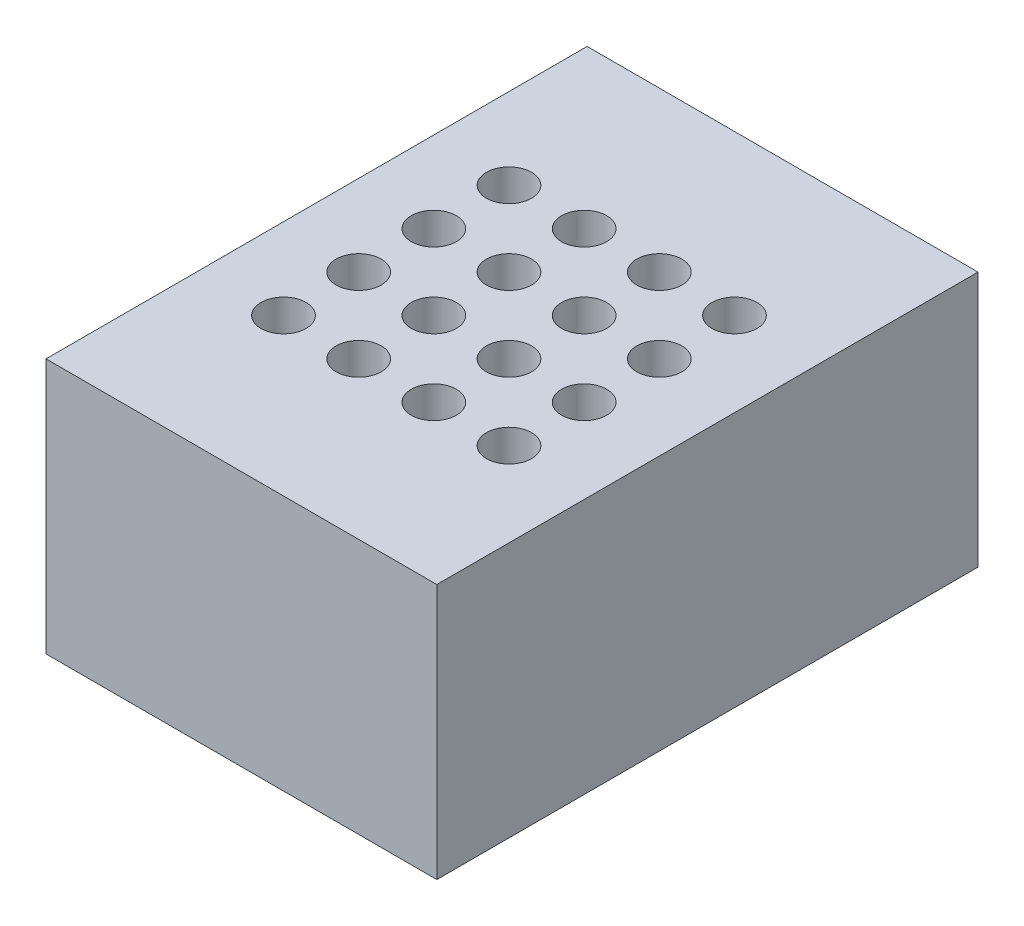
from build123d import *

# Parameters (mm, degrees)
SKETCH1_W           = 13
SKETCH1_H           = 18
BOSS_EXTRUDE1_DEPTH = 8.5
SKETCH2_R           = 0.75
CUT_EXTRUDE1_DEPTH  = 7
SKETCH3_W           = 9.571128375
SKETCH3_H           = 1.059255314
SKETCH3_H_2         = 1.210577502
CUT_EXTRUDE2_DEPTH  = 1.5


with BuildPart() as part:
    # Sketch1 → Boss-Extrude1 (new body)
    with BuildSketch(Plane(origin=(0, 0, 0), x_dir=(1, 0, 0), z_dir=(0, 1, 0))):
        with Locations((0.665012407, -3.305210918)):
            Rectangle(SKETCH1_W, SKETCH1_H)
    extrude(amount=BOSS_EXTRUDE1_DEPTH)

    # Sketch2 → Cut-Extrude1 (cut)
    with BuildSketch(Plane(origin=(0, 8.5, 0), x_dir=(1, 0, 0), z_dir=(0, 1, 0))):
        with Locations(Location((4.365012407, 0.394789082, 0), (0, 0, 270))):
            Circle(SKETCH2_R)
        with Locations(Location((1.865012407, 0.394789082, 0), (0, 0, 270))):
            Circle(SKETCH2_R)
        with Locations(Location((-0.634987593, 0.394789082, 0), (0, 0, 270))):
            Circle(SKETCH2_R)
        with Locations(Location((-3.134987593, 0.394789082, 0), (0, 0, 270))):
            Circle(SKETCH2_R)
        with Locations(Location((1.865012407, -2.105210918, 0), (0, 0, 270))):
            Circle(SKETCH2_R)
        with Locations(Location((-0.634987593, -2.105210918, 0), (0, 0, 270))):
            Circle(SKETCH2_R)
        with Locations(Location((-3.134987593, -2.105210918, 0), (0, 0, 270))):
            Circle(SKETCH2_R)
        with Locations(Location((1.865012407, -4.605210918, 0), (0, 0, 270))):
            Circle(SKETCH2_R)
        with Locations(Location((-0.634987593, -4.605210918, 0), (0, 0, 270))):
            Circle(SKETCH2_R)
        with Locations(Location((-3.134987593, -4.605210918, 0), (0, 0, 270))):
            Circle(SKETCH2_R)
        with Locations(Location((1.865012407, -7.105210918, 0), (0, 0, 270))):
            Circle(SKETCH2_R)
        with Locations(Location((-0.634987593, -7.105210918, 0), (0, 0, 270))):
            Circle(SKETCH2_R)
        with Locations(Location((-3.134987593, -7.105210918, 0), (0, 0, 270))):
            Circle(SKETCH2_R)
        with Locations(Location((4.365012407, -2.105210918, 0), (0, 0, 270))):
            Circle(SKETCH2_R)
        with Locations(Location((4.365012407, -4.605210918, 0), (0, 0, 270))):
            Circle(SKETCH2_R)
        with Locations(Location((4.365012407, -7.105210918, 0), (0, 0, 270))):
            Circle(SKETCH2_R)
    extrude(amount=-CUT_EXTRUDE1_DEPTH, mode=Mode.SUBTRACT)

    # Sketch3 → Cut-Extrude2 (cut)
    with BuildSketch(Plane.XZ):
        with Locations((0.665012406, 9.925556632)):
            Rectangle(SKETCH3_W, SKETCH3_H)
        with Locations((0.665012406, -3.844762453)):
            Rectangle(SKETCH3_W, SKETCH3_H_2)
    extrude(amount=-CUT_EXTRUDE2_DEPTH, mode=Mode.SUBTRACT)


solid = part.part
